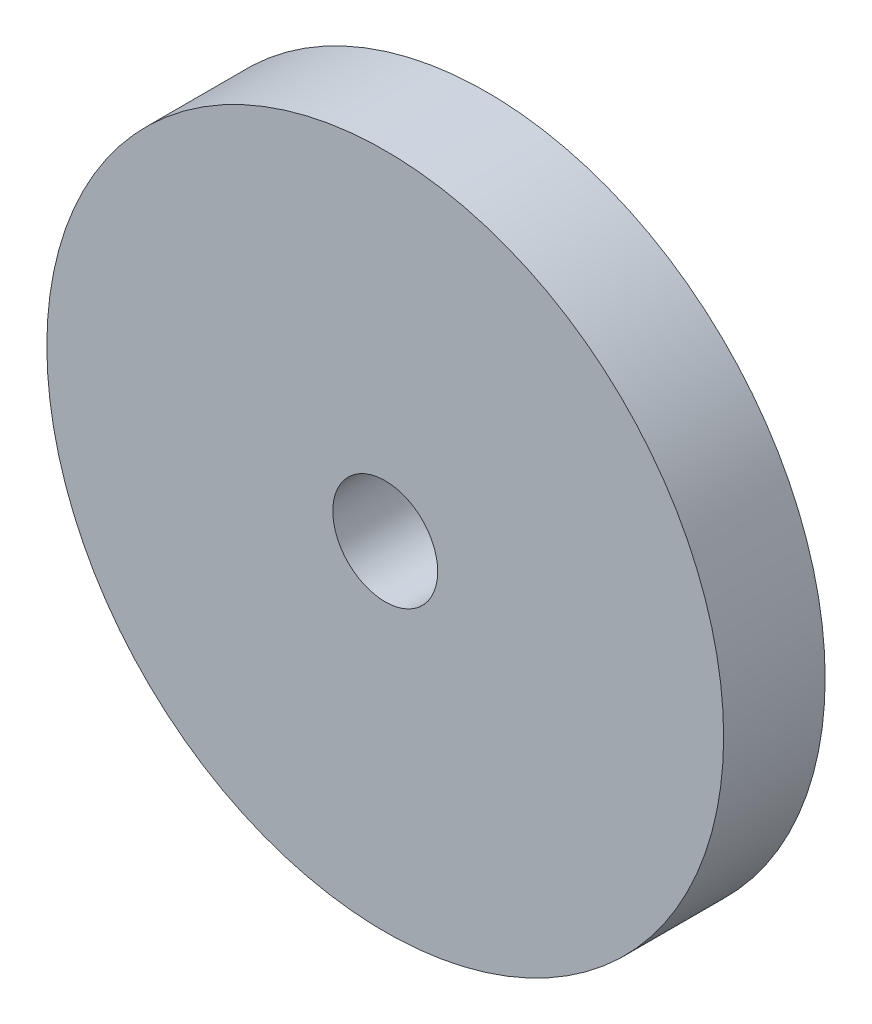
from build123d import *

# Parameters (mm, degrees)
ESQUISSE1_R      = 20
ESQUISSE1_R_2    = 3.1
EXTRUSION1_DEPTH = 6


with BuildPart() as part:
    # Esquisse1 → Extrusion1 (new body)
    with BuildSketch(Plane.XY):
        Circle(ESQUISSE1_R)
        Circle(ESQUISSE1_R_2, mode=Mode.SUBTRACT)
    extrude(amount=EXTRUSION1_DEPTH)


solid = part.part
